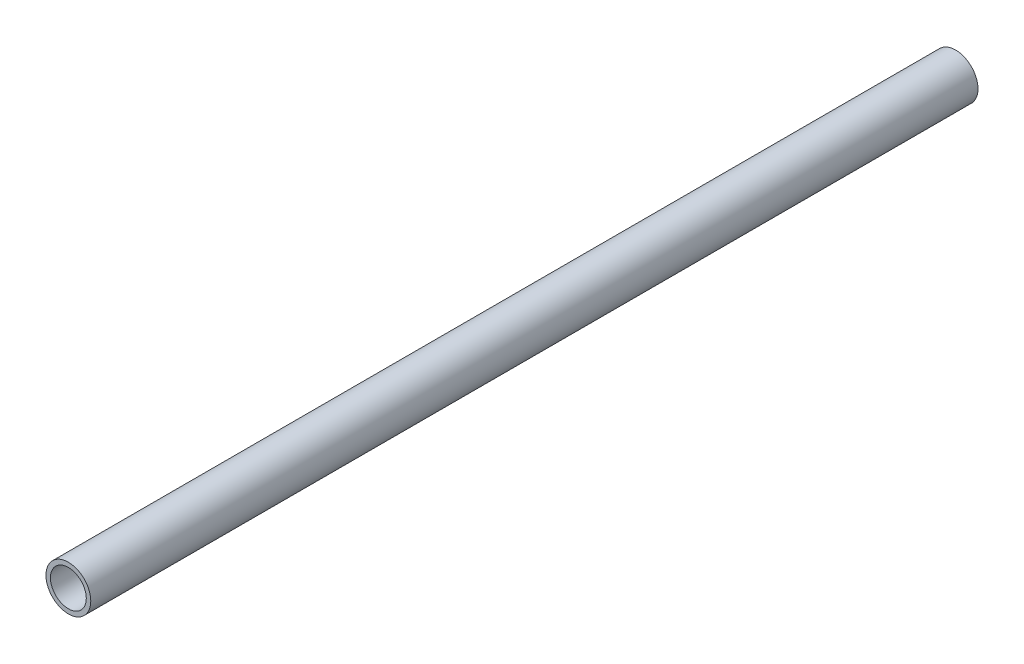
from build123d import *

# Parameters (mm, degrees)
SKETCH1_R           = 15.875
SKETCH1_R_2         = 12.7
BOSS_EXTRUDE1_DEPTH = 314.325


with BuildPart() as part:
    # Sketch1 → Boss-Extrude1 (new, symmetric)
    with BuildSketch(Plane.XY):
        Circle(SKETCH1_R)
        Circle(SKETCH1_R_2, mode=Mode.SUBTRACT)
    extrude(amount=BOSS_EXTRUDE1_DEPTH, both=True)


solid = part.part
